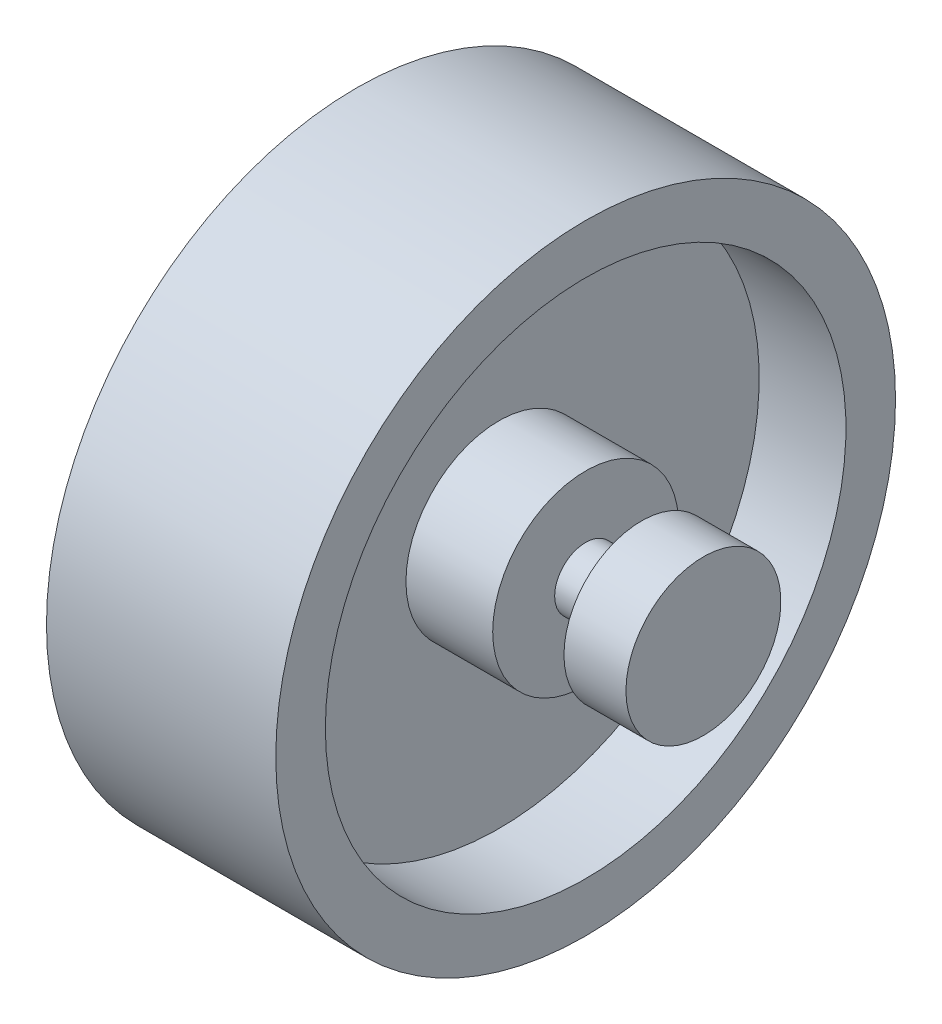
from build123d import *


with BuildPart() as part:
    # Esquisse1 → R_volution1 (revolve)
    with BuildSketch(Plane.XY, mode=Mode.PRIVATE) as r_volution1_sk:
        Polygon((-37.5, 0), (37.5, 0), (37.5, 12.5), (27.5, 12.5), (27.5, 5), (18.5, 5), (18.5, 15), (4.5, 15), (4.5, 42), (18.5, 42), (18.5, 50), (-18.5, 50), (-18.5, 42), (-4.5, 42), (-4.5, 15), (-18.5, 15), (-18.5, 5), (-27.5, 5), (-27.5, 12.5), (-37.5, 12.5), align=None)
    revolve(r_volution1_sk.sketch.rotate(Axis((-37.5, 0, 0), (1, 0, 0)), 90), axis=Axis((-37.5, 0, 0), (1, 0, 0)))


solid = part.part
